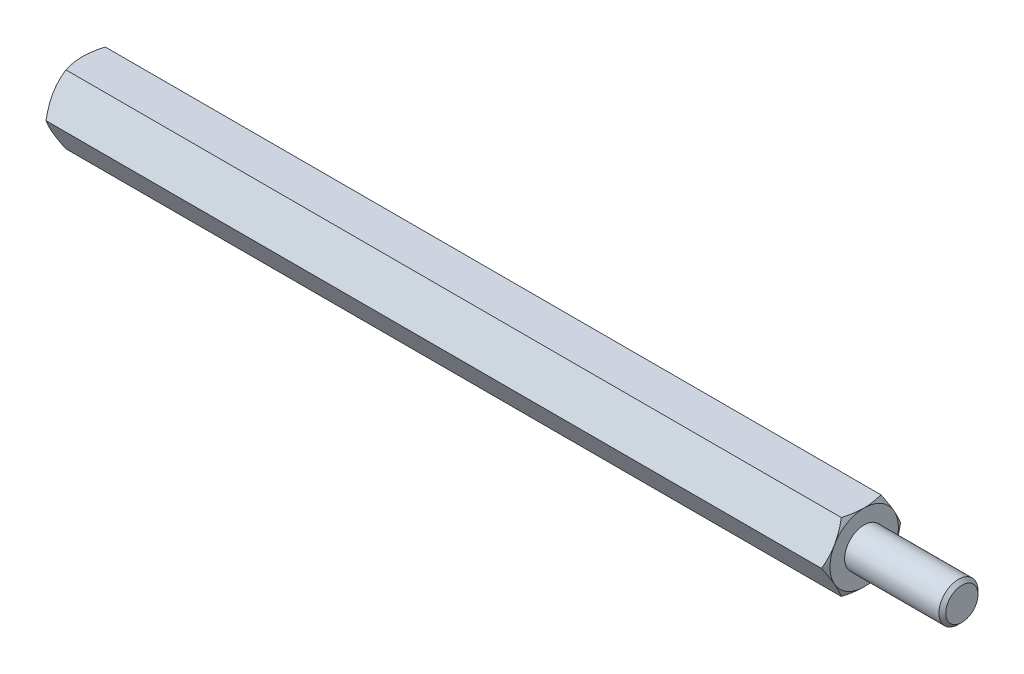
ISO-10303-21;
HEADER;
FILE_DESCRIPTION(('STEP AP214'),'2;1');
FILE_NAME('part.step','',(''),(''),'','','');
FILE_SCHEMA(('AUTOMOTIVE_DESIGN { 1 0 10303 214 1 1 1 1 }'));
ENDSEC;
DATA;
#1=APPLICATION_CONTEXT('core data for automotive mechanical design processes');
#2=APPLICATION_PROTOCOL_DEFINITION('international standard','automotive_design',2000,#1);
#3=PRODUCT_CONTEXT('',#1,'mechanical');
#4=PRODUCT('Part','Part','',(#3));
#5=PRODUCT_RELATED_PRODUCT_CATEGORY('part','',(#4));
#6=PRODUCT_DEFINITION_FORMATION('','',#4);
#7=PRODUCT_DEFINITION_CONTEXT('part definition',#1,'design');
#8=PRODUCT_DEFINITION('design','',#6,#7);
#9=PRODUCT_DEFINITION_SHAPE('','',#8);
#10=(LENGTH_UNIT() NAMED_UNIT(*) SI_UNIT(.MILLI.,.METRE.));
#11=(NAMED_UNIT(*) PLANE_ANGLE_UNIT() SI_UNIT($,.RADIAN.));
#12=(NAMED_UNIT(*) SI_UNIT($,.STERADIAN.) SOLID_ANGLE_UNIT());
#13=UNCERTAINTY_MEASURE_WITH_UNIT(LENGTH_MEASURE(1.E-05),#10,'distance_accuracy_value','');
#14=(GEOMETRIC_REPRESENTATION_CONTEXT(3) GLOBAL_UNCERTAINTY_ASSIGNED_CONTEXT((#13)) GLOBAL_UNIT_ASSIGNED_CONTEXT((#10,
#11,#12)) REPRESENTATION_CONTEXT('',''));
#15=CARTESIAN_POINT('',(0.,0.,0.));
#16=DIRECTION('',(0.,0.,1.));
#17=DIRECTION('',(1.,0.,0.));
#18=AXIS2_PLACEMENT_3D('',#15,#16,#17);
#19=CARTESIAN_POINT('',(40.,3.5,-2.02072594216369));
#20=DIRECTION('',(1.,0.,0.));
#21=DIRECTION('',(0.,0.,-1.));
#22=AXIS2_PLACEMENT_3D('',#19,#20,#21);
#23=PLANE('',#22);
#24=CARTESIAN_POINT('',(40.,0.,0.));
#25=DIRECTION('',(1.,0.,0.));
#26=DIRECTION('',(0.,0.,-1.));
#27=AXIS2_PLACEMENT_3D('',#24,#25,#26);
#28=CIRCLE('',#27,3.50000000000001);
#29=CARTESIAN_POINT('',(40.,-1.75000000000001,-3.03108891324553));
#30=VERTEX_POINT('',#29);
#31=CARTESIAN_POINT('',(40.,1.75,-3.03108891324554));
#32=VERTEX_POINT('',#31);
#33=EDGE_CURVE('E288',#30,#32,#28,.T.);
#34=ORIENTED_EDGE('',*,*,#33,.T.);
#35=CARTESIAN_POINT('',(40.,3.5,0.));
#36=VERTEX_POINT('',#35);
#37=EDGE_CURVE('E53',#32,#36,#28,.T.);
#38=ORIENTED_EDGE('',*,*,#37,.T.);
#39=CARTESIAN_POINT('',(40.,1.75,3.03108891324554));
#40=VERTEX_POINT('',#39);
#41=EDGE_CURVE('E296',#36,#40,#28,.T.);
#42=ORIENTED_EDGE('',*,*,#41,.T.);
#43=CARTESIAN_POINT('',(40.,-1.75000000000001,3.03108891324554));
#44=VERTEX_POINT('',#43);
#45=EDGE_CURVE('E301',#40,#44,#28,.T.);
#46=ORIENTED_EDGE('',*,*,#45,.T.);
#47=CARTESIAN_POINT('',(40.,0.,0.));
#48=DIRECTION('',(-1.,0.,0.));
#49=DIRECTION('',(0.,-1.,0.));
#50=AXIS2_PLACEMENT_3D('',#47,#48,#49);
#51=CIRCLE('',#50,3.50000000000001);
#52=CARTESIAN_POINT('',(40.,-3.50000000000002,0.));
#53=VERTEX_POINT('',#52);
#54=EDGE_CURVE('E193',#53,#44,#51,.T.);
#55=ORIENTED_EDGE('',*,*,#54,.F.);
#56=EDGE_CURVE('E61',#53,#30,#28,.T.);
#57=ORIENTED_EDGE('',*,*,#56,.T.);
#58=EDGE_LOOP('',(#34,#38,#42,#46,#55,#57));
#59=FACE_BOUND('',#58,.T.);
#60=CARTESIAN_POINT('',(40.,0.,0.));
#61=DIRECTION('',(1.,0.,0.));
#62=DIRECTION('',(0.,0.,-1.));
#63=AXIS2_PLACEMENT_3D('',#60,#61,#62);
#64=CIRCLE('',#63,2.);
#65=CARTESIAN_POINT('',(40.,0.,-2.));
#66=VERTEX_POINT('',#65);
#67=EDGE_CURVE('E368',#66,#66,#64,.T.);
#68=ORIENTED_EDGE('',*,*,#67,.F.);
#69=EDGE_LOOP('',(#68));
#70=FACE_BOUND('',#69,.T.);
#71=ADVANCED_FACE('F37',(#59,#70),#23,.T.);
#72=CARTESIAN_POINT('',(40.,0.,-4.04145188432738));
#73=DIRECTION('',(0.,-0.5,0.866025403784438));
#74=DIRECTION('',(0.,-0.866025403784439,-0.5));
#75=AXIS2_PLACEMENT_3D('',#72,#73,#74);
#76=PLANE('',#75);
#77=CARTESIAN_POINT('',(39.6873259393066,-0.000200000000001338,-4.04156735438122));
#78=CARTESIAN_POINT('',(39.73861421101,0.153607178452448,-3.9527667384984));
#79=CARTESIAN_POINT('',(39.7852590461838,0.308742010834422,-3.86319960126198));
#80=CARTESIAN_POINT('',(39.8666781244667,0.621698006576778,-3.68251437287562));
#81=CARTESIAN_POINT('',(39.9014235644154,0.779524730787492,-3.59139307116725));
#82=CARTESIAN_POINT('',(39.9555099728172,1.09322221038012,-3.41027974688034));
#83=CARTESIAN_POINT('',(39.9752109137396,1.24904469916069,-3.32031559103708));
#84=CARTESIAN_POINT('',(39.9987298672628,1.56142288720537,-3.13996396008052));
#85=CARTESIAN_POINT('',(40.0025673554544,1.71797745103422,-3.04957714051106));
#86=CARTESIAN_POINT('',(39.994584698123,2.01050921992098,-2.88068384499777));
#87=CARTESIAN_POINT('',(39.9847245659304,2.1465302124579,-2.80215208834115));
#88=CARTESIAN_POINT('',(39.9534735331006,2.41768602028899,-2.64560020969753));
#89=CARTESIAN_POINT('',(39.9320719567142,2.55281989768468,-2.5675806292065));
#90=CARTESIAN_POINT('',(39.8785695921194,2.82453479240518,-2.41070596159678));
#91=CARTESIAN_POINT('',(39.8462420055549,2.96108141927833,-2.33187072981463));
#92=CARTESIAN_POINT('',(39.772871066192,3.2321380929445,-2.17537608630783));
#93=CARTESIAN_POINT('',(39.7318449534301,3.36665161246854,-2.09771466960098));
#94=CARTESIAN_POINT('',(39.6873259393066,3.5002,-2.02061047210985));
#95=B_SPLINE_CURVE_WITH_KNOTS('',3,(#77,#78,#79,#80,#81,#82,#83,#84,#85,#86,#87,#88,#89,#90,#91,
#92,#93,#94),.UNSPECIFIED.,.F.,.F.,(4,2,2,2,2,2,2,2,4),(0.,0.554793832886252,1.11092123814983,
1.65328467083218,2.19498204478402,2.66665130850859,3.13875761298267,3.62133612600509,
4.10296698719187),.UNSPECIFIED.);
#96=CARTESIAN_POINT('',(39.6873926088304,0.,-4.04145188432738));
#97=VERTEX_POINT('',#96);
#98=EDGE_CURVE('E329',#97,#32,#95,.T.);
#99=ORIENTED_EDGE('',*,*,#98,.F.);
#100=DIRECTION('',(-1.,0.,0.));
#101=VECTOR('',#100,1.);
#102=CARTESIAN_POINT('',(40.,0.,-4.04145188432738));
#103=LINE('',#102,#101);
#104=CARTESIAN_POINT('',(-39.6873926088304,0.,-4.04145188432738));
#105=VERTEX_POINT('',#104);
#106=EDGE_CURVE('E264',#97,#105,#103,.T.);
#107=ORIENTED_EDGE('',*,*,#106,.T.);
#108=CARTESIAN_POINT('',(-39.6873259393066,3.5002,-2.02061047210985));
#109=CARTESIAN_POINT('',(-39.73861421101,3.34639282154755,-2.10941108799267));
#110=CARTESIAN_POINT('',(-39.7852590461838,3.19125798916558,-2.19897822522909));
#111=CARTESIAN_POINT('',(-39.8666781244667,2.87830199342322,-2.37966345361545));
#112=CARTESIAN_POINT('',(-39.9014235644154,2.7204752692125,-2.47078475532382));
#113=CARTESIAN_POINT('',(-39.9555099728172,2.40677778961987,-2.65189807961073));
#114=CARTESIAN_POINT('',(-39.9752109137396,2.25095530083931,-2.74186223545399));
#115=CARTESIAN_POINT('',(-39.9987298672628,1.93857711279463,-2.92221386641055));
#116=CARTESIAN_POINT('',(-40.0025673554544,1.78202254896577,-3.01260068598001));
#117=CARTESIAN_POINT('',(-39.994584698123,1.48949078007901,-3.1814939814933));
#118=CARTESIAN_POINT('',(-39.9847245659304,1.35346978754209,-3.26002573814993));
#119=CARTESIAN_POINT('',(-39.9534735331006,1.08231397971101,-3.41657761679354));
#120=CARTESIAN_POINT('',(-39.9320719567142,0.947180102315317,-3.49459719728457));
#121=CARTESIAN_POINT('',(-39.8785695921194,0.675465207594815,-3.65147186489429));
#122=CARTESIAN_POINT('',(-39.8462420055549,0.538918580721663,-3.73030709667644));
#123=CARTESIAN_POINT('',(-39.772871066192,0.267861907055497,-3.88680174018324));
#124=CARTESIAN_POINT('',(-39.7318449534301,0.133348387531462,-3.96446315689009));
#125=CARTESIAN_POINT('',(-39.6873259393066,-0.000200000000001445,-4.04156735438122));
#126=B_SPLINE_CURVE_WITH_KNOTS('',3,(#108,#109,#110,#111,#112,#113,#114,#115,#116,#117,#118,
#119,#120,#121,#122,#123,#124,#125),.UNSPECIFIED.,.F.,.F.,(4,2,2,2,2,2,2,2,4),(0.,
0.554793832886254,1.11092123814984,1.65328467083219,2.19498204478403,2.6666513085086,
3.13875761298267,3.6213361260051,4.10296698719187),.UNSPECIFIED.);
#127=CARTESIAN_POINT('',(-40.,1.75,-3.03108891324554));
#128=VERTEX_POINT('',#127);
#129=EDGE_CURVE('E406',#128,#105,#126,.T.);
#130=ORIENTED_EDGE('',*,*,#129,.F.);
#131=CARTESIAN_POINT('',(-39.6873926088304,3.5,-2.02072594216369));
#132=VERTEX_POINT('',#131);
#133=EDGE_CURVE('E383',#132,#128,#126,.T.);
#134=ORIENTED_EDGE('',*,*,#133,.F.);
#135=DIRECTION('',(-1.,0.,0.));
#136=VECTOR('',#135,1.);
#137=CARTESIAN_POINT('',(40.,3.5,-2.02072594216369));
#138=LINE('',#137,#136);
#139=CARTESIAN_POINT('',(39.6873926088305,3.5,-2.02072594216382));
#140=VERTEX_POINT('',#139);
#141=EDGE_CURVE('E279',#140,#132,#138,.T.);
#142=ORIENTED_EDGE('',*,*,#141,.F.);
#143=EDGE_CURVE('E229',#32,#140,#95,.T.);
#144=ORIENTED_EDGE('',*,*,#143,.F.);
#145=EDGE_LOOP('',(#99,#107,#130,#134,#142,#144));
#146=FACE_BOUND('',#145,.T.);
#147=ADVANCED_FACE('F148',(#146),#76,.F.);
#148=CARTESIAN_POINT('',(40.,3.5,-2.02072594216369));
#149=DIRECTION('',(0.,-1.,0.));
#150=DIRECTION('',(0.,0.,-1.));
#151=AXIS2_PLACEMENT_3D('',#148,#149,#150);
#152=PLANE('',#151);
#153=CARTESIAN_POINT('',(38.2443294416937,3.5,-5.525713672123));
#154=CARTESIAN_POINT('',(38.3192813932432,3.5,-5.37200190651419));
#155=CARTESIAN_POINT('',(38.393542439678,3.5,-5.21794762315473));
#156=CARTESIAN_POINT('',(38.5402960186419,3.5,-4.90897223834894));
#157=CARTESIAN_POINT('',(38.6127882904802,3.5,-4.75405101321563));
#158=CARTESIAN_POINT('',(38.7559617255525,3.5,-4.44240758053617));
#159=CARTESIAN_POINT('',(38.8266316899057,3.5,-4.28568021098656));
#160=CARTESIAN_POINT('',(38.9652074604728,3.5,-3.97101270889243));
#161=CARTESIAN_POINT('',(39.0331133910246,3.5,-3.81307263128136));
#162=CARTESIAN_POINT('',(39.1677143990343,3.5,-3.49026114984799));
#163=CARTESIAN_POINT('',(39.2342871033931,3.5,-3.32533845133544));
#164=CARTESIAN_POINT('',(39.3626267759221,3.5,-2.99359992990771));
#165=CARTESIAN_POINT('',(39.4243932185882,3.5,-2.82678390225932));
#166=CARTESIAN_POINT('',(39.5415700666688,3.5,-2.49127529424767));
#167=CARTESIAN_POINT('',(39.5969925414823,3.5,-2.32258697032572));
#168=CARTESIAN_POINT('',(39.6997679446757,3.5,-1.98279215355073));
#169=CARTESIAN_POINT('',(39.7471233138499,3.5,-1.81168640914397));
#170=CARTESIAN_POINT('',(39.8312987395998,3.5,-1.46793354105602));
#171=CARTESIAN_POINT('',(39.8681796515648,3.5,-1.2953015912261));
#172=CARTESIAN_POINT('',(39.9293955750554,3.5,-0.947791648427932));
#173=CARTESIAN_POINT('',(39.953731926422,3.5,-0.77291389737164));
#174=CARTESIAN_POINT('',(39.9876038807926,3.5,-0.424108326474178));
#175=CARTESIAN_POINT('',(39.997337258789,3.5,-0.25020019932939));
#176=CARTESIAN_POINT('',(40.0017053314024,3.5,0.0978233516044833));
#177=CARTESIAN_POINT('',(39.9963399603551,3.5,0.271938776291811));
#178=CARTESIAN_POINT('',(39.9750118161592,3.5,0.564711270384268));
#179=CARTESIAN_POINT('',(39.9628919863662,3.5,0.683667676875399));
#180=CARTESIAN_POINT('',(39.9323080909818,3.5,0.920767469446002));
#181=CARTESIAN_POINT('',(39.9138432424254,3.5,1.03891075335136));
#182=CARTESIAN_POINT('',(39.8498956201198,3.5,1.39193174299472));
#183=CARTESIAN_POINT('',(39.7958695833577,3.5,1.62528232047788));
#184=CARTESIAN_POINT('',(39.7014515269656,3.5,1.9743382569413));
#185=CARTESIAN_POINT('',(39.6672900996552,3.5,2.09183268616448));
#186=CARTESIAN_POINT('',(39.595234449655,3.5,2.32568238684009));
#187=CARTESIAN_POINT('',(39.5573401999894,3.5,2.44203765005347));
#188=CARTESIAN_POINT('',(39.4784421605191,3.5,2.67364238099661));
#189=CARTESIAN_POINT('',(39.4374392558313,3.5,2.7888921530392));
#190=CARTESIAN_POINT('',(39.352824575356,3.5,3.0184246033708));
#191=CARTESIAN_POINT('',(39.3092128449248,3.5,3.13270729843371));
#192=CARTESIAN_POINT('',(39.1958241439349,3.5,3.42150510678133));
#193=CARTESIAN_POINT('',(39.1245636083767,3.5,3.59543696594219));
#194=CARTESIAN_POINT('',(38.9781026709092,3.5,3.94163961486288));
#195=CARTESIAN_POINT('',(38.9029019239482,3.5,4.11391025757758));
#196=CARTESIAN_POINT('',(38.7494252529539,3.5,4.45713072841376));
#197=CARTESIAN_POINT('',(38.6711484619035,3.5,4.62808016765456));
#198=CARTESIAN_POINT('',(38.512188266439,3.5,4.96885843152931));
#199=CARTESIAN_POINT('',(38.4315047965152,3.5,5.1386872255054));
#200=CARTESIAN_POINT('',(38.1863871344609,3.5,5.64726192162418));
#201=CARTESIAN_POINT('',(38.0190975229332,3.5,5.98463020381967));
#202=CARTESIAN_POINT('',(37.6795854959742,3.5,6.65678495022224));
#203=CARTESIAN_POINT('',(37.5073639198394,3.5,6.99157184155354));
#204=CARTESIAN_POINT('',(37.1760800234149,3.5,7.62749570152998));
#205=CARTESIAN_POINT('',(37.0173299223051,3.5,7.92879562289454));
#206=CARTESIAN_POINT('',(36.6977473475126,3.5,8.53030635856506));
#207=CARTESIAN_POINT('',(36.5369147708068,3.5,8.83051711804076));
#208=CARTESIAN_POINT('',(36.2141792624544,3.5,9.42918006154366));
#209=CARTESIAN_POINT('',(36.0522810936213,3.5,9.72763481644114));
#210=CARTESIAN_POINT('',(35.7272737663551,3.5,10.3238577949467));
#211=CARTESIAN_POINT('',(35.5641646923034,3.5,10.6216260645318));
#212=CARTESIAN_POINT('',(35.4006104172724,3.5,10.9191478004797));
#213=B_SPLINE_CURVE_WITH_KNOTS('',3,(#153,#154,#155,#156,#157,#158,#159,#160,#161,#162,#163,
#164,#165,#166,#167,#168,#169,#170,#171,#172,#173,#174,#175,#176,#177,#178,#179,#180,#181,#182,
#183,#184,#185,#186,#187,#188,#189,#190,#191,#192,#193,#194,#195,#196,#197,#198,#199,#200,#201,
#202,#203,#204,#205,#206,#207,#208,#209,#210,#211,#212),.UNSPECIFIED.,.F.,.F.,(4,2,2,2,2,2,2,2,
2,2,2,2,2,2,2,2,2,2,2,2,2,2,2,2,2,2,2,2,2,4),(0.,0.513041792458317,1.02615874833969,
1.54190801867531,2.05763406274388,2.59113284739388,3.1246898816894,3.65721433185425,
4.18957737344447,4.71878103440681,5.24792816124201,5.76984197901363,6.29175806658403,
6.65030258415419,7.00889136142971,7.72642330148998,8.0934692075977,8.46051776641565,
8.82746220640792,9.19440026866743,9.75822236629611,10.3220939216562,10.8861255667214,
11.4501725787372,12.579801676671,13.7092396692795,14.730918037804,15.7526471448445,
16.771258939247,17.7898004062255),.UNSPECIFIED.);
#214=EDGE_CURVE('E227',#140,#36,#213,.T.);
#215=ORIENTED_EDGE('',*,*,#214,.F.);
#216=ORIENTED_EDGE('',*,*,#141,.T.);
#217=CARTESIAN_POINT('',(-38.2443294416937,3.5,-5.525713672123));
#218=CARTESIAN_POINT('',(-38.3192813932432,3.5,-5.37200190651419));
#219=CARTESIAN_POINT('',(-38.393542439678,3.5,-5.21794762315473));
#220=CARTESIAN_POINT('',(-38.5402960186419,3.5,-4.90897223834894));
#221=CARTESIAN_POINT('',(-38.6127882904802,3.5,-4.75405101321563));
#222=CARTESIAN_POINT('',(-38.7559617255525,3.5,-4.44240758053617));
#223=CARTESIAN_POINT('',(-38.8266316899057,3.5,-4.28568021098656));
#224=CARTESIAN_POINT('',(-38.9652074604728,3.5,-3.97101270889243));
#225=CARTESIAN_POINT('',(-39.0331133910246,3.5,-3.81307263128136));
#226=CARTESIAN_POINT('',(-39.1677143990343,3.5,-3.49026114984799));
#227=CARTESIAN_POINT('',(-39.2342871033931,3.5,-3.32533845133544));
#228=CARTESIAN_POINT('',(-39.3626267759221,3.5,-2.99359992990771));
#229=CARTESIAN_POINT('',(-39.4243932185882,3.5,-2.82678390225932));
#230=CARTESIAN_POINT('',(-39.5415700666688,3.5,-2.49127529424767));
#231=CARTESIAN_POINT('',(-39.5969925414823,3.5,-2.32258697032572));
#232=CARTESIAN_POINT('',(-39.6997679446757,3.5,-1.98279215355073));
#233=CARTESIAN_POINT('',(-39.7471233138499,3.5,-1.81168640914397));
#234=CARTESIAN_POINT('',(-39.8312987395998,3.5,-1.46793354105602));
#235=CARTESIAN_POINT('',(-39.8681796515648,3.5,-1.2953015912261));
#236=CARTESIAN_POINT('',(-39.9293955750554,3.5,-0.947791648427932));
#237=CARTESIAN_POINT('',(-39.953731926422,3.5,-0.77291389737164));
#238=CARTESIAN_POINT('',(-39.9876038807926,3.5,-0.424108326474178));
#239=CARTESIAN_POINT('',(-39.997337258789,3.5,-0.25020019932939));
#240=CARTESIAN_POINT('',(-40.0017053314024,3.5,0.0978233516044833));
#241=CARTESIAN_POINT('',(-39.9963399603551,3.5,0.271938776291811));
#242=CARTESIAN_POINT('',(-39.9750118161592,3.5,0.564711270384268));
#243=CARTESIAN_POINT('',(-39.9628919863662,3.5,0.683667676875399));
#244=CARTESIAN_POINT('',(-39.9323080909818,3.5,0.920767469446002));
#245=CARTESIAN_POINT('',(-39.9138432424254,3.5,1.03891075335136));
#246=CARTESIAN_POINT('',(-39.8498956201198,3.5,1.39193174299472));
#247=CARTESIAN_POINT('',(-39.7958695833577,3.5,1.62528232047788));
#248=CARTESIAN_POINT('',(-39.7014515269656,3.5,1.9743382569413));
#249=CARTESIAN_POINT('',(-39.6672900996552,3.5,2.09183268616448));
#250=CARTESIAN_POINT('',(-39.595234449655,3.5,2.32568238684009));
#251=CARTESIAN_POINT('',(-39.5573401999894,3.5,2.44203765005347));
#252=CARTESIAN_POINT('',(-39.4784421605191,3.5,2.67364238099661));
#253=CARTESIAN_POINT('',(-39.4374392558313,3.5,2.7888921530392));
#254=CARTESIAN_POINT('',(-39.352824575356,3.5,3.0184246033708));
#255=CARTESIAN_POINT('',(-39.3092128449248,3.5,3.13270729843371));
#256=CARTESIAN_POINT('',(-39.1958241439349,3.5,3.42150510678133));
#257=CARTESIAN_POINT('',(-39.1245636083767,3.5,3.59543696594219));
#258=CARTESIAN_POINT('',(-38.9781026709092,3.5,3.94163961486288));
#259=CARTESIAN_POINT('',(-38.9029019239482,3.5,4.11391025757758));
#260=CARTESIAN_POINT('',(-38.7494252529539,3.5,4.45713072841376));
#261=CARTESIAN_POINT('',(-38.6711484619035,3.5,4.62808016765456));
#262=CARTESIAN_POINT('',(-38.512188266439,3.5,4.96885843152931));
#263=CARTESIAN_POINT('',(-38.4315047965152,3.5,5.1386872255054));
#264=CARTESIAN_POINT('',(-38.1863871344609,3.5,5.64726192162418));
#265=CARTESIAN_POINT('',(-38.0190975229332,3.5,5.98463020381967));
#266=CARTESIAN_POINT('',(-37.6795854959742,3.5,6.65678495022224));
#267=CARTESIAN_POINT('',(-37.5073639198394,3.5,6.99157184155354));
#268=CARTESIAN_POINT('',(-37.1760800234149,3.5,7.62749570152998));
#269=CARTESIAN_POINT('',(-37.0173299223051,3.5,7.92879562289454));
#270=CARTESIAN_POINT('',(-36.6977473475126,3.5,8.53030635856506));
#271=CARTESIAN_POINT('',(-36.5369147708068,3.5,8.83051711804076));
#272=CARTESIAN_POINT('',(-36.2141792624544,3.5,9.42918006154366));
#273=CARTESIAN_POINT('',(-36.0522810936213,3.5,9.72763481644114));
#274=CARTESIAN_POINT('',(-35.7272737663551,3.5,10.3238577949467));
#275=CARTESIAN_POINT('',(-35.5641646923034,3.5,10.6216260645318));
#276=CARTESIAN_POINT('',(-35.4006104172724,3.5,10.9191478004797));
#277=B_SPLINE_CURVE_WITH_KNOTS('',3,(#217,#218,#219,#220,#221,#222,#223,#224,#225,#226,#227,
#228,#229,#230,#231,#232,#233,#234,#235,#236,#237,#238,#239,#240,#241,#242,#243,#244,#245,#246,
#247,#248,#249,#250,#251,#252,#253,#254,#255,#256,#257,#258,#259,#260,#261,#262,#263,#264,#265,
#266,#267,#268,#269,#270,#271,#272,#273,#274,#275,#276),.UNSPECIFIED.,.F.,.F.,(4,2,2,2,2,2,2,2,
2,2,2,2,2,2,2,2,2,2,2,2,2,2,2,2,2,2,2,2,2,4),(0.,0.513041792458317,1.02615874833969,
1.54190801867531,2.05763406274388,2.59113284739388,3.1246898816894,3.65721433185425,
4.18957737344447,4.71878103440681,5.24792816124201,5.76984197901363,6.29175806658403,
6.65030258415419,7.00889136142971,7.72642330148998,8.0934692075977,8.46051776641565,
8.82746220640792,9.19440026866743,9.75822236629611,10.3220939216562,10.8861255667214,
11.4501725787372,12.579801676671,13.7092396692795,14.730918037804,15.7526471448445,
16.771258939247,17.7898004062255),.UNSPECIFIED.);
#278=CARTESIAN_POINT('',(-40.,3.5,0.));
#279=VERTEX_POINT('',#278);
#280=EDGE_CURVE('E241',#279,#132,#277,.F.);
#281=ORIENTED_EDGE('',*,*,#280,.F.);
#282=CARTESIAN_POINT('',(-39.6873926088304,3.5,2.02072594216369));
#283=VERTEX_POINT('',#282);
#284=EDGE_CURVE('E249',#283,#279,#277,.F.);
#285=ORIENTED_EDGE('',*,*,#284,.F.);
#286=DIRECTION('',(-1.,0.,0.));
#287=VECTOR('',#286,1.);
#288=CARTESIAN_POINT('',(40.,3.5,2.02072594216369));
#289=LINE('',#288,#287);
#290=CARTESIAN_POINT('',(39.6873926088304,3.5,2.02072594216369));
#291=VERTEX_POINT('',#290);
#292=EDGE_CURVE('E276',#291,#283,#289,.T.);
#293=ORIENTED_EDGE('',*,*,#292,.F.);
#294=EDGE_CURVE('E221',#36,#291,#213,.T.);
#295=ORIENTED_EDGE('',*,*,#294,.F.);
#296=EDGE_LOOP('',(#215,#216,#281,#285,#293,#295));
#297=FACE_BOUND('',#296,.T.);
#298=ADVANCED_FACE('F153',(#297),#152,.F.);
#299=CARTESIAN_POINT('',(40.,3.5,2.02072594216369));
#300=DIRECTION('',(0.,-0.5,-0.866025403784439));
#301=DIRECTION('',(0.,0.866025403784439,-0.5));
#302=AXIS2_PLACEMENT_3D('',#299,#300,#301);
#303=PLANE('',#302);
#304=CARTESIAN_POINT('',(39.6873259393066,3.5002,2.02061047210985));
#305=CARTESIAN_POINT('',(39.73861421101,3.34639282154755,2.10941108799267));
#306=CARTESIAN_POINT('',(39.7852590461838,3.19125798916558,2.19897822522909));
#307=CARTESIAN_POINT('',(39.8666781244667,2.87830199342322,2.37966345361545));
#308=CARTESIAN_POINT('',(39.9014235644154,2.7204752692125,2.47078475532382));
#309=CARTESIAN_POINT('',(39.9555099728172,2.40677778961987,2.65189807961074));
#310=CARTESIAN_POINT('',(39.9752109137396,2.25095530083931,2.74186223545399));
#311=CARTESIAN_POINT('',(39.9987298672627,1.93857711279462,2.92221386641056));
#312=CARTESIAN_POINT('',(40.0025673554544,1.78202254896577,3.01260068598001));
#313=CARTESIAN_POINT('',(39.994584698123,1.48949078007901,3.1814939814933));
#314=CARTESIAN_POINT('',(39.9847245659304,1.35346978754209,3.26002573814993));
#315=CARTESIAN_POINT('',(39.9534735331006,1.082313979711,3.41657761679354));
#316=CARTESIAN_POINT('',(39.9320719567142,0.947180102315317,3.49459719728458));
#317=CARTESIAN_POINT('',(39.8785695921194,0.675465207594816,3.65147186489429));
#318=CARTESIAN_POINT('',(39.8462420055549,0.538918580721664,3.73030709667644));
#319=CARTESIAN_POINT('',(39.772871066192,0.267861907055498,3.88680174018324));
#320=CARTESIAN_POINT('',(39.7318449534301,0.133348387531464,3.96446315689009));
#321=CARTESIAN_POINT('',(39.6873259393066,-0.000200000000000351,4.04156735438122));
#322=B_SPLINE_CURVE_WITH_KNOTS('',3,(#304,#305,#306,#307,#308,#309,#310,#311,#312,#313,#314,
#315,#316,#317,#318,#319,#320,#321),.UNSPECIFIED.,.F.,.F.,(4,2,2,2,2,2,2,2,4),(0.,
0.554793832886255,1.11092123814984,1.65328467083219,2.19498204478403,2.6666513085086,
3.13875761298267,3.62133612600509,4.10296698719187),.UNSPECIFIED.);
#323=EDGE_CURVE('E228',#291,#40,#322,.T.);
#324=ORIENTED_EDGE('',*,*,#323,.F.);
#325=ORIENTED_EDGE('',*,*,#292,.T.);
#326=CARTESIAN_POINT('',(-39.6873259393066,-0.000200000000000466,4.04156735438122));
#327=CARTESIAN_POINT('',(-39.73861421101,0.153607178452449,3.9527667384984));
#328=CARTESIAN_POINT('',(-39.7852590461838,0.308742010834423,3.86319960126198));
#329=CARTESIAN_POINT('',(-39.8666781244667,0.62169800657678,3.68251437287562));
#330=CARTESIAN_POINT('',(-39.9014235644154,0.779524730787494,3.59139307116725));
#331=CARTESIAN_POINT('',(-39.9555099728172,1.09322221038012,3.41027974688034));
#332=CARTESIAN_POINT('',(-39.9752109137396,1.24904469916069,3.32031559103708));
#333=CARTESIAN_POINT('',(-39.9987298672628,1.56142288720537,3.13996396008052));
#334=CARTESIAN_POINT('',(-40.0025673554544,1.71797745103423,3.04957714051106));
#335=CARTESIAN_POINT('',(-39.994584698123,2.01050921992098,2.88068384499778));
#336=CARTESIAN_POINT('',(-39.9847245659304,2.1465302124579,2.80215208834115));
#337=CARTESIAN_POINT('',(-39.9534735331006,2.41768602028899,2.64560020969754));
#338=CARTESIAN_POINT('',(-39.9320719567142,2.55281989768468,2.5675806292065));
#339=CARTESIAN_POINT('',(-39.8785695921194,2.82453479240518,2.41070596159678));
#340=CARTESIAN_POINT('',(-39.8462420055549,2.96108141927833,2.33187072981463));
#341=CARTESIAN_POINT('',(-39.772871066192,3.2321380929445,2.17537608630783));
#342=CARTESIAN_POINT('',(-39.7318449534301,3.36665161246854,2.09771466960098));
#343=CARTESIAN_POINT('',(-39.6873259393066,3.5002,2.02061047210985));
#344=B_SPLINE_CURVE_WITH_KNOTS('',3,(#326,#327,#328,#329,#330,#331,#332,#333,#334,#335,#336,
#337,#338,#339,#340,#341,#342,#343),.UNSPECIFIED.,.F.,.F.,(4,2,2,2,2,2,2,2,4),(0.,
0.554793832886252,1.11092123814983,1.65328467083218,2.19498204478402,2.66665130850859,
3.13875761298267,3.62133612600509,4.10296698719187),.UNSPECIFIED.);
#345=CARTESIAN_POINT('',(-40.,1.75,3.03108891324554));
#346=VERTEX_POINT('',#345);
#347=EDGE_CURVE('E255',#346,#283,#344,.T.);
#348=ORIENTED_EDGE('',*,*,#347,.F.);
#349=CARTESIAN_POINT('',(-39.6873926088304,0.,4.04145188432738));
#350=VERTEX_POINT('',#349);
#351=EDGE_CURVE('E262',#350,#346,#344,.T.);
#352=ORIENTED_EDGE('',*,*,#351,.F.);
#353=DIRECTION('',(-1.,0.,0.));
#354=VECTOR('',#353,1.);
#355=CARTESIAN_POINT('',(40.,0.,4.04145188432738));
#356=LINE('',#355,#354);
#357=CARTESIAN_POINT('',(39.6873926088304,0.,4.04145188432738));
#358=VERTEX_POINT('',#357);
#359=EDGE_CURVE('E273',#358,#350,#356,.T.);
#360=ORIENTED_EDGE('',*,*,#359,.F.);
#361=EDGE_CURVE('E215',#40,#358,#322,.T.);
#362=ORIENTED_EDGE('',*,*,#361,.F.);
#363=EDGE_LOOP('',(#324,#325,#348,#352,#360,#362));
#364=FACE_BOUND('',#363,.T.);
#365=ADVANCED_FACE('F235',(#364),#303,.F.);
#366=CARTESIAN_POINT('',(40.,0.,4.04145188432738));
#367=DIRECTION('',(0.,0.5,-0.866025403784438));
#368=DIRECTION('',(0.,0.866025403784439,0.5));
#369=AXIS2_PLACEMENT_3D('',#366,#367,#368);
#370=PLANE('',#369);
#371=CARTESIAN_POINT('',(39.6873259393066,0.000199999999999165,4.04156735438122));
#372=CARTESIAN_POINT('',(39.73861421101,-0.15360717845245,3.9527667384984));
#373=CARTESIAN_POINT('',(39.7852590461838,-0.308742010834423,3.86319960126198));
#374=CARTESIAN_POINT('',(39.8666781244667,-0.62169800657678,3.68251437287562));
#375=CARTESIAN_POINT('',(39.9014235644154,-0.779524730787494,3.59139307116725));
#376=CARTESIAN_POINT('',(39.9555099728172,-1.09322221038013,3.41027974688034));
#377=CARTESIAN_POINT('',(39.9752109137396,-1.24904469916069,3.32031559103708));
#378=CARTESIAN_POINT('',(39.9987298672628,-1.56142288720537,3.13996396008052));
#379=CARTESIAN_POINT('',(40.0025673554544,-1.71797745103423,3.04957714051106));
#380=CARTESIAN_POINT('',(39.994584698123,-2.01050921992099,2.88068384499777));
#381=CARTESIAN_POINT('',(39.9847245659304,-2.1465302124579,2.80215208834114));
#382=CARTESIAN_POINT('',(39.9534735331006,-2.41768602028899,2.64560020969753));
#383=CARTESIAN_POINT('',(39.9320719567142,-2.55281989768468,2.5675806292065));
#384=CARTESIAN_POINT('',(39.8785695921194,-2.82453479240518,2.41070596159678));
#385=CARTESIAN_POINT('',(39.8462420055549,-2.96108141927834,2.33187072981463));
#386=CARTESIAN_POINT('',(39.772871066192,-3.2321380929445,2.17537608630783));
#387=CARTESIAN_POINT('',(39.7318449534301,-3.36665161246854,2.09771466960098));
#388=CARTESIAN_POINT('',(39.6873259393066,-3.5002,2.02061047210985));
#389=B_SPLINE_CURVE_WITH_KNOTS('',3,(#371,#372,#373,#374,#375,#376,#377,#378,#379,#380,#381,
#382,#383,#384,#385,#386,#387,#388),.UNSPECIFIED.,.F.,.F.,(4,2,2,2,2,2,2,2,4),(0.,
0.55479383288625,1.11092123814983,1.65328467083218,2.19498204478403,2.6666513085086,
3.13875761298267,3.62133612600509,4.10296698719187),.UNSPECIFIED.);
#390=EDGE_CURVE('E353',#358,#44,#389,.T.);
#391=ORIENTED_EDGE('',*,*,#390,.F.);
#392=ORIENTED_EDGE('',*,*,#359,.T.);
#393=CARTESIAN_POINT('',(-39.6873259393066,-3.5002,2.02061047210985));
#394=CARTESIAN_POINT('',(-39.73861421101,-3.34639282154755,2.10941108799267));
#395=CARTESIAN_POINT('',(-39.7852590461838,-3.19125798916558,2.19897822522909));
#396=CARTESIAN_POINT('',(-39.8666781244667,-2.87830199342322,2.37966345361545));
#397=CARTESIAN_POINT('',(-39.9014235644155,-2.72047526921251,2.47078475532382));
#398=CARTESIAN_POINT('',(-39.9555099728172,-2.40677778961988,2.65189807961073));
#399=CARTESIAN_POINT('',(-39.9752109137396,-2.25095530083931,2.74186223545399));
#400=CARTESIAN_POINT('',(-39.9987298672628,-1.93857711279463,2.92221386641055));
#401=CARTESIAN_POINT('',(-40.0025673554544,-1.78202254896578,3.01260068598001));
#402=CARTESIAN_POINT('',(-39.994584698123,-1.48949078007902,3.18149398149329));
#403=CARTESIAN_POINT('',(-39.9847245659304,-1.3534697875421,3.26002573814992));
#404=CARTESIAN_POINT('',(-39.9534735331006,-1.08231397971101,3.41657761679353));
#405=CARTESIAN_POINT('',(-39.9320719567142,-0.947180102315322,3.49459719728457));
#406=CARTESIAN_POINT('',(-39.8785695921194,-0.67546520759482,3.65147186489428));
#407=CARTESIAN_POINT('',(-39.8462420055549,-0.538918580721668,3.73030709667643));
#408=CARTESIAN_POINT('',(-39.772871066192,-0.267861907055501,3.88680174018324));
#409=CARTESIAN_POINT('',(-39.7318449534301,-0.133348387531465,3.96446315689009));
#410=CARTESIAN_POINT('',(-39.6873259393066,0.000199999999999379,4.04156735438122));
#411=B_SPLINE_CURVE_WITH_KNOTS('',3,(#393,#394,#395,#396,#397,#398,#399,#400,#401,#402,#403,
#404,#405,#406,#407,#408,#409,#410),.UNSPECIFIED.,.F.,.F.,(4,2,2,2,2,2,2,2,4),(0.,
0.554793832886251,1.11092123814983,1.65328467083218,2.19498204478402,2.66665130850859,
3.13875761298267,3.62133612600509,4.10296698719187),.UNSPECIFIED.);
#412=CARTESIAN_POINT('',(-40.,-1.75000000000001,3.03108891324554));
#413=VERTEX_POINT('',#412);
#414=EDGE_CURVE('E263',#413,#350,#411,.T.);
#415=ORIENTED_EDGE('',*,*,#414,.F.);
#416=CARTESIAN_POINT('',(-39.6873926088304,-3.5,2.02072594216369));
#417=VERTEX_POINT('',#416);
#418=EDGE_CURVE('E250',#417,#413,#411,.T.);
#419=ORIENTED_EDGE('',*,*,#418,.F.);
#420=DIRECTION('',(-1.,0.,0.));
#421=VECTOR('',#420,1.);
#422=CARTESIAN_POINT('',(40.,-3.5,2.02072594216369));
#423=LINE('',#422,#421);
#424=CARTESIAN_POINT('',(39.6873926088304,-3.5,2.02072594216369));
#425=VERTEX_POINT('',#424);
#426=EDGE_CURVE('E270',#425,#417,#423,.T.);
#427=ORIENTED_EDGE('',*,*,#426,.F.);
#428=EDGE_CURVE('E210',#44,#425,#389,.T.);
#429=ORIENTED_EDGE('',*,*,#428,.F.);
#430=EDGE_LOOP('',(#391,#392,#415,#419,#427,#429));
#431=FACE_BOUND('',#430,.T.);
#432=ADVANCED_FACE('F429',(#431),#370,.F.);
#433=CARTESIAN_POINT('',(40.,-3.5,2.02072594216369));
#434=DIRECTION('',(0.,1.,0.));
#435=DIRECTION('',(0.,0.,1.));
#436=AXIS2_PLACEMENT_3D('',#433,#434,#435);
#437=PLANE('',#436);
#438=CARTESIAN_POINT('',(38.2443294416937,-3.5,-5.52571367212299));
#439=CARTESIAN_POINT('',(38.3192813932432,-3.5,-5.37200190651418));
#440=CARTESIAN_POINT('',(38.393542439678,-3.5,-5.21794762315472));
#441=CARTESIAN_POINT('',(38.5402960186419,-3.5,-4.90897223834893));
#442=CARTESIAN_POINT('',(38.6127882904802,-3.5,-4.75405101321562));
#443=CARTESIAN_POINT('',(38.7559617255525,-3.5,-4.44240758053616));
#444=CARTESIAN_POINT('',(38.8266316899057,-3.5,-4.28568021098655));
#445=CARTESIAN_POINT('',(38.9652074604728,-3.5,-3.97101270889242));
#446=CARTESIAN_POINT('',(39.0331133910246,-3.5,-3.81307263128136));
#447=CARTESIAN_POINT('',(39.1677143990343,-3.5,-3.49026114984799));
#448=CARTESIAN_POINT('',(39.2342871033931,-3.5,-3.32533845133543));
#449=CARTESIAN_POINT('',(39.3626267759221,-3.5,-2.99359992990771));
#450=CARTESIAN_POINT('',(39.4243932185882,-3.5,-2.82678390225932));
#451=CARTESIAN_POINT('',(39.5415700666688,-3.5,-2.49127529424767));
#452=CARTESIAN_POINT('',(39.5969925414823,-3.5,-2.32258697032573));
#453=CARTESIAN_POINT('',(39.6997679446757,-3.5,-1.98279215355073));
#454=CARTESIAN_POINT('',(39.7471233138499,-3.5,-1.81168640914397));
#455=CARTESIAN_POINT('',(39.8312987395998,-3.5,-1.46793354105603));
#456=CARTESIAN_POINT('',(39.8681796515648,-3.5,-1.2953015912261));
#457=CARTESIAN_POINT('',(39.9293955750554,-3.5,-0.947791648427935));
#458=CARTESIAN_POINT('',(39.953731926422,-3.5,-0.772913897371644));
#459=CARTESIAN_POINT('',(39.9876038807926,-3.5,-0.424108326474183));
#460=CARTESIAN_POINT('',(39.997337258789,-3.5,-0.250200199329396));
#461=CARTESIAN_POINT('',(40.0017053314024,-3.5,0.0978233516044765));
#462=CARTESIAN_POINT('',(39.9963399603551,-3.5,0.271938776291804));
#463=CARTESIAN_POINT('',(39.9750118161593,-3.5,0.564711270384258));
#464=CARTESIAN_POINT('',(39.9628919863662,-3.5,0.683667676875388));
#465=CARTESIAN_POINT('',(39.9323080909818,-3.5,0.920767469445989));
#466=CARTESIAN_POINT('',(39.9138432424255,-3.5,1.03891075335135));
#467=CARTESIAN_POINT('',(39.8498956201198,-3.5,1.3919317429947));
#468=CARTESIAN_POINT('',(39.7958695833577,-3.5,1.62528232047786));
#469=CARTESIAN_POINT('',(39.7014515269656,-3.5,1.97433825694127));
#470=CARTESIAN_POINT('',(39.6672900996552,-3.5,2.09183268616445));
#471=CARTESIAN_POINT('',(39.5952344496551,-3.5,2.32568238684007));
#472=CARTESIAN_POINT('',(39.5573401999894,-3.5,2.44203765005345));
#473=CARTESIAN_POINT('',(39.4784421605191,-3.5,2.67364238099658));
#474=CARTESIAN_POINT('',(39.4374392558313,-3.5,2.78889215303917));
#475=CARTESIAN_POINT('',(39.352824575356,-3.5,3.01842460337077));
#476=CARTESIAN_POINT('',(39.3092128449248,-3.5,3.13270729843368));
#477=CARTESIAN_POINT('',(39.1958241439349,-3.5,3.4215051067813));
#478=CARTESIAN_POINT('',(39.1245636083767,-3.5,3.59543696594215));
#479=CARTESIAN_POINT('',(38.9781026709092,-3.5,3.94163961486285));
#480=CARTESIAN_POINT('',(38.9029019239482,-3.5,4.11391025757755));
#481=CARTESIAN_POINT('',(38.7494252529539,-3.5,4.45713072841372));
#482=CARTESIAN_POINT('',(38.6711484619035,-3.5,4.62808016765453));
#483=CARTESIAN_POINT('',(38.5121882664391,-3.5,4.96885843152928));
#484=CARTESIAN_POINT('',(38.4315047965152,-3.5,5.13868722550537));
#485=CARTESIAN_POINT('',(38.186387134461,-3.5,5.64726192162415));
#486=CARTESIAN_POINT('',(38.0190975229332,-3.5,5.98463020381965));
#487=CARTESIAN_POINT('',(37.6795854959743,-3.5,6.65678495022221));
#488=CARTESIAN_POINT('',(37.5073639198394,-3.5,6.99157184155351));
#489=CARTESIAN_POINT('',(37.176080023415,-3.5,7.62749570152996));
#490=CARTESIAN_POINT('',(37.0173299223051,-3.5,7.92879562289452));
#491=CARTESIAN_POINT('',(36.6977473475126,-3.5,8.53030635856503));
#492=CARTESIAN_POINT('',(36.5369147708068,-3.5,8.83051711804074));
#493=CARTESIAN_POINT('',(36.2141792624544,-3.5,9.42918006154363));
#494=CARTESIAN_POINT('',(36.0522810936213,-3.5,9.72763481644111));
#495=CARTESIAN_POINT('',(35.7272737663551,-3.5,10.3238577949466));
#496=CARTESIAN_POINT('',(35.5641646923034,-3.5,10.6216260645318));
#497=CARTESIAN_POINT('',(35.4006104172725,-3.5,10.9191478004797));
#498=B_SPLINE_CURVE_WITH_KNOTS('',3,(#438,#439,#440,#441,#442,#443,#444,#445,#446,#447,#448,
#449,#450,#451,#452,#453,#454,#455,#456,#457,#458,#459,#460,#461,#462,#463,#464,#465,#466,#467,
#468,#469,#470,#471,#472,#473,#474,#475,#476,#477,#478,#479,#480,#481,#482,#483,#484,#485,#486,
#487,#488,#489,#490,#491,#492,#493,#494,#495,#496,#497),.UNSPECIFIED.,.F.,.F.,(4,2,2,2,2,2,2,2,
2,2,2,2,2,2,2,2,2,2,2,2,2,2,2,2,2,2,2,2,2,4),(0.,0.513041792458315,1.02615874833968,
1.5419080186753,2.05763406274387,2.59113284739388,3.12468988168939,3.65721433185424,
4.18957737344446,4.7187810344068,5.24792816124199,5.76984197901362,6.29175806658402,
6.65030258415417,7.00889136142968,7.72642330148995,8.09346920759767,8.46051776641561,
8.82746220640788,9.19440026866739,9.75822236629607,10.3220939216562,10.8861255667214,
11.4501725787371,12.579801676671,13.7092396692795,14.730918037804,15.7526471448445,
16.7712589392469,17.7898004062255),.UNSPECIFIED.);
#499=EDGE_CURVE('E317',#425,#53,#498,.F.);
#500=ORIENTED_EDGE('',*,*,#499,.F.);
#501=ORIENTED_EDGE('',*,*,#426,.T.);
#502=CARTESIAN_POINT('',(-38.2443294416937,-3.5,-5.52571367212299));
#503=CARTESIAN_POINT('',(-38.3192813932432,-3.5,-5.37200190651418));
#504=CARTESIAN_POINT('',(-38.393542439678,-3.5,-5.21794762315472));
#505=CARTESIAN_POINT('',(-38.5402960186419,-3.5,-4.90897223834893));
#506=CARTESIAN_POINT('',(-38.6127882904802,-3.5,-4.75405101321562));
#507=CARTESIAN_POINT('',(-38.7559617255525,-3.5,-4.44240758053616));
#508=CARTESIAN_POINT('',(-38.8266316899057,-3.5,-4.28568021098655));
#509=CARTESIAN_POINT('',(-38.9652074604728,-3.5,-3.97101270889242));
#510=CARTESIAN_POINT('',(-39.0331133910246,-3.5,-3.81307263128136));
#511=CARTESIAN_POINT('',(-39.1677143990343,-3.5,-3.49026114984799));
#512=CARTESIAN_POINT('',(-39.2342871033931,-3.5,-3.32533845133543));
#513=CARTESIAN_POINT('',(-39.3626267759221,-3.5,-2.99359992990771));
#514=CARTESIAN_POINT('',(-39.4243932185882,-3.5,-2.82678390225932));
#515=CARTESIAN_POINT('',(-39.5415700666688,-3.5,-2.49127529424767));
#516=CARTESIAN_POINT('',(-39.5969925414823,-3.5,-2.32258697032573));
#517=CARTESIAN_POINT('',(-39.6997679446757,-3.5,-1.98279215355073));
#518=CARTESIAN_POINT('',(-39.7471233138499,-3.5,-1.81168640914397));
#519=CARTESIAN_POINT('',(-39.8312987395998,-3.5,-1.46793354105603));
#520=CARTESIAN_POINT('',(-39.8681796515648,-3.5,-1.2953015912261));
#521=CARTESIAN_POINT('',(-39.9293955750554,-3.5,-0.947791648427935));
#522=CARTESIAN_POINT('',(-39.953731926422,-3.5,-0.772913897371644));
#523=CARTESIAN_POINT('',(-39.9876038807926,-3.5,-0.424108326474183));
#524=CARTESIAN_POINT('',(-39.997337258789,-3.5,-0.250200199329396));
#525=CARTESIAN_POINT('',(-40.0017053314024,-3.5,0.0978233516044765));
#526=CARTESIAN_POINT('',(-39.9963399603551,-3.5,0.271938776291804));
#527=CARTESIAN_POINT('',(-39.9750118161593,-3.5,0.564711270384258));
#528=CARTESIAN_POINT('',(-39.9628919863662,-3.5,0.683667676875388));
#529=CARTESIAN_POINT('',(-39.9323080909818,-3.5,0.920767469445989));
#530=CARTESIAN_POINT('',(-39.9138432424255,-3.5,1.03891075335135));
#531=CARTESIAN_POINT('',(-39.8498956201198,-3.5,1.3919317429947));
#532=CARTESIAN_POINT('',(-39.7958695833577,-3.5,1.62528232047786));
#533=CARTESIAN_POINT('',(-39.7014515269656,-3.5,1.97433825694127));
#534=CARTESIAN_POINT('',(-39.6672900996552,-3.5,2.09183268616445));
#535=CARTESIAN_POINT('',(-39.5952344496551,-3.5,2.32568238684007));
#536=CARTESIAN_POINT('',(-39.5573401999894,-3.5,2.44203765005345));
#537=CARTESIAN_POINT('',(-39.4784421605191,-3.5,2.67364238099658));
#538=CARTESIAN_POINT('',(-39.4374392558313,-3.5,2.78889215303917));
#539=CARTESIAN_POINT('',(-39.352824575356,-3.5,3.01842460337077));
#540=CARTESIAN_POINT('',(-39.3092128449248,-3.5,3.13270729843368));
#541=CARTESIAN_POINT('',(-39.1958241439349,-3.5,3.4215051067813));
#542=CARTESIAN_POINT('',(-39.1245636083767,-3.5,3.59543696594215));
#543=CARTESIAN_POINT('',(-38.9781026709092,-3.5,3.94163961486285));
#544=CARTESIAN_POINT('',(-38.9029019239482,-3.5,4.11391025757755));
#545=CARTESIAN_POINT('',(-38.7494252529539,-3.5,4.45713072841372));
#546=CARTESIAN_POINT('',(-38.6711484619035,-3.5,4.62808016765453));
#547=CARTESIAN_POINT('',(-38.5121882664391,-3.5,4.96885843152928));
#548=CARTESIAN_POINT('',(-38.4315047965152,-3.5,5.13868722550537));
#549=CARTESIAN_POINT('',(-38.186387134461,-3.5,5.64726192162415));
#550=CARTESIAN_POINT('',(-38.0190975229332,-3.5,5.98463020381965));
#551=CARTESIAN_POINT('',(-37.6795854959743,-3.5,6.65678495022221));
#552=CARTESIAN_POINT('',(-37.5073639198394,-3.5,6.99157184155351));
#553=CARTESIAN_POINT('',(-37.176080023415,-3.5,7.62749570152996));
#554=CARTESIAN_POINT('',(-37.0173299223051,-3.5,7.92879562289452));
#555=CARTESIAN_POINT('',(-36.6977473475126,-3.5,8.53030635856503));
#556=CARTESIAN_POINT('',(-36.5369147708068,-3.5,8.83051711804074));
#557=CARTESIAN_POINT('',(-36.2141792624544,-3.5,9.42918006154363));
#558=CARTESIAN_POINT('',(-36.0522810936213,-3.5,9.72763481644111));
#559=CARTESIAN_POINT('',(-35.7272737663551,-3.5,10.3238577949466));
#560=CARTESIAN_POINT('',(-35.5641646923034,-3.5,10.6216260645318));
#561=CARTESIAN_POINT('',(-35.4006104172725,-3.5,10.9191478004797));
#562=B_SPLINE_CURVE_WITH_KNOTS('',3,(#502,#503,#504,#505,#506,#507,#508,#509,#510,#511,#512,
#513,#514,#515,#516,#517,#518,#519,#520,#521,#522,#523,#524,#525,#526,#527,#528,#529,#530,#531,
#532,#533,#534,#535,#536,#537,#538,#539,#540,#541,#542,#543,#544,#545,#546,#547,#548,#549,#550,
#551,#552,#553,#554,#555,#556,#557,#558,#559,#560,#561),.UNSPECIFIED.,.F.,.F.,(4,2,2,2,2,2,2,2,
2,2,2,2,2,2,2,2,2,2,2,2,2,2,2,2,2,2,2,2,2,4),(0.,0.513041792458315,1.02615874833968,
1.5419080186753,2.05763406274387,2.59113284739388,3.12468988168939,3.65721433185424,
4.18957737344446,4.7187810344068,5.24792816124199,5.76984197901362,6.29175806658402,
6.65030258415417,7.00889136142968,7.72642330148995,8.09346920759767,8.46051776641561,
8.82746220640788,9.19440026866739,9.75822236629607,10.3220939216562,10.8861255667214,
11.4501725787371,12.579801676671,13.7092396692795,14.730918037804,15.7526471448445,
16.7712589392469,17.7898004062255),.UNSPECIFIED.);
#563=CARTESIAN_POINT('',(-40.,-3.50000000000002,0.));
#564=VERTEX_POINT('',#563);
#565=EDGE_CURVE('E376',#564,#417,#562,.T.);
#566=ORIENTED_EDGE('',*,*,#565,.F.);
#567=CARTESIAN_POINT('',(-39.6873926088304,-3.5,-2.02072594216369));
#568=VERTEX_POINT('',#567);
#569=EDGE_CURVE('E384',#568,#564,#562,.T.);
#570=ORIENTED_EDGE('',*,*,#569,.F.);
#571=DIRECTION('',(-1.,0.,0.));
#572=VECTOR('',#571,1.);
#573=CARTESIAN_POINT('',(40.,-3.5,-2.02072594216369));
#574=LINE('',#573,#572);
#575=CARTESIAN_POINT('',(39.6873926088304,-3.5,-2.02072594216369));
#576=VERTEX_POINT('',#575);
#577=EDGE_CURVE('E267',#576,#568,#574,.T.);
#578=ORIENTED_EDGE('',*,*,#577,.F.);
#579=EDGE_CURVE('E195',#53,#576,#498,.F.);
#580=ORIENTED_EDGE('',*,*,#579,.F.);
#581=EDGE_LOOP('',(#500,#501,#566,#570,#578,#580));
#582=FACE_BOUND('',#581,.T.);
#583=ADVANCED_FACE('F172',(#582),#437,.F.);
#584=CARTESIAN_POINT('',(40.,-3.5,-2.02072594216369));
#585=DIRECTION('',(0.,0.5,0.866025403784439));
#586=DIRECTION('',(0.,-0.866025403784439,0.5));
#587=AXIS2_PLACEMENT_3D('',#584,#585,#586);
#588=PLANE('',#587);
#589=CARTESIAN_POINT('',(39.6873259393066,-3.5002,-2.02061047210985));
#590=CARTESIAN_POINT('',(39.73861421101,-3.34639282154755,-2.10941108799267));
#591=CARTESIAN_POINT('',(39.7852590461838,-3.19125798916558,-2.19897822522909));
#592=CARTESIAN_POINT('',(39.8666781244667,-2.87830199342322,-2.37966345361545));
#593=CARTESIAN_POINT('',(39.9014235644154,-2.72047526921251,-2.47078475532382));
#594=CARTESIAN_POINT('',(39.9555099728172,-2.40677778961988,-2.65189807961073));
#595=CARTESIAN_POINT('',(39.9752109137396,-2.25095530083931,-2.74186223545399));
#596=CARTESIAN_POINT('',(39.9987298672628,-1.93857711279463,-2.92221386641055));
#597=CARTESIAN_POINT('',(40.0025673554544,-1.78202254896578,-3.01260068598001));
#598=CARTESIAN_POINT('',(39.994584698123,-1.48949078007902,-3.18149398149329));
#599=CARTESIAN_POINT('',(39.9847245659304,-1.3534697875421,-3.26002573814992));
#600=CARTESIAN_POINT('',(39.9534735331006,-1.08231397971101,-3.41657761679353));
#601=CARTESIAN_POINT('',(39.9320719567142,-0.947180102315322,-3.49459719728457));
#602=CARTESIAN_POINT('',(39.8785695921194,-0.67546520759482,-3.65147186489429));
#603=CARTESIAN_POINT('',(39.8462420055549,-0.538918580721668,-3.73030709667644));
#604=CARTESIAN_POINT('',(39.772871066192,-0.267861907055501,-3.88680174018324));
#605=CARTESIAN_POINT('',(39.7318449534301,-0.133348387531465,-3.96446315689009));
#606=CARTESIAN_POINT('',(39.6873259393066,0.000199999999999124,-4.04156735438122));
#607=B_SPLINE_CURVE_WITH_KNOTS('',3,(#589,#590,#591,#592,#593,#594,#595,#596,#597,#598,#599,
#600,#601,#602,#603,#604,#605,#606),.UNSPECIFIED.,.F.,.F.,(4,2,2,2,2,2,2,2,4),(0.,
0.554793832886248,1.11092123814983,1.65328467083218,2.19498204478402,2.66665130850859,
3.13875761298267,3.62133612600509,4.10296698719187),.UNSPECIFIED.);
#608=EDGE_CURVE('E192',#576,#30,#607,.T.);
#609=ORIENTED_EDGE('',*,*,#608,.F.);
#610=ORIENTED_EDGE('',*,*,#577,.T.);
#611=CARTESIAN_POINT('',(-39.6873259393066,0.000199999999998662,-4.04156735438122));
#612=CARTESIAN_POINT('',(-39.73861421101,-0.15360717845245,-3.9527667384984));
#613=CARTESIAN_POINT('',(-39.7852590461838,-0.308742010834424,-3.86319960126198));
#614=CARTESIAN_POINT('',(-39.8666781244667,-0.62169800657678,-3.68251437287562));
#615=CARTESIAN_POINT('',(-39.9014235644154,-0.779524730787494,-3.59139307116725));
#616=CARTESIAN_POINT('',(-39.9555099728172,-1.09322221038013,-3.41027974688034));
#617=CARTESIAN_POINT('',(-39.9752109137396,-1.24904469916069,-3.32031559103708));
#618=CARTESIAN_POINT('',(-39.9987298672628,-1.56142288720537,-3.13996396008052));
#619=CARTESIAN_POINT('',(-40.0025673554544,-1.71797745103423,-3.04957714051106));
#620=CARTESIAN_POINT('',(-39.994584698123,-2.01050921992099,-2.88068384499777));
#621=CARTESIAN_POINT('',(-39.9847245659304,-2.1465302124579,-2.80215208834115));
#622=CARTESIAN_POINT('',(-39.9534735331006,-2.41768602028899,-2.64560020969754));
#623=CARTESIAN_POINT('',(-39.9320719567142,-2.55281989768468,-2.5675806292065));
#624=CARTESIAN_POINT('',(-39.8785695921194,-2.82453479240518,-2.41070596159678));
#625=CARTESIAN_POINT('',(-39.8462420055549,-2.96108141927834,-2.33187072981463));
#626=CARTESIAN_POINT('',(-39.772871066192,-3.2321380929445,-2.17537608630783));
#627=CARTESIAN_POINT('',(-39.7318449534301,-3.36665161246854,-2.09771466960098));
#628=CARTESIAN_POINT('',(-39.6873259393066,-3.5002,-2.02061047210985));
#629=B_SPLINE_CURVE_WITH_KNOTS('',3,(#611,#612,#613,#614,#615,#616,#617,#618,#619,#620,#621,
#622,#623,#624,#625,#626,#627,#628),.UNSPECIFIED.,.F.,.F.,(4,2,2,2,2,2,2,2,4),(0.,
0.55479383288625,1.11092123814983,1.65328467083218,2.19498204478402,2.66665130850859,
3.13875761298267,3.62133612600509,4.10296698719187),.UNSPECIFIED.);
#630=CARTESIAN_POINT('',(-40.,-1.75000000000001,-3.03108891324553));
#631=VERTEX_POINT('',#630);
#632=EDGE_CURVE('E178',#631,#568,#629,.T.);
#633=ORIENTED_EDGE('',*,*,#632,.F.);
#634=EDGE_CURVE('E315',#105,#631,#629,.T.);
#635=ORIENTED_EDGE('',*,*,#634,.F.);
#636=ORIENTED_EDGE('',*,*,#106,.F.);
#637=EDGE_CURVE('E185',#30,#97,#607,.T.);
#638=ORIENTED_EDGE('',*,*,#637,.F.);
#639=EDGE_LOOP('',(#609,#610,#633,#635,#636,#638));
#640=FACE_BOUND('',#639,.T.);
#641=ADVANCED_FACE('F167',(#640),#588,.F.);
#642=CARTESIAN_POINT('',(-40.,0.,0.));
#643=DIRECTION('',(1.,0.,0.));
#644=DIRECTION('',(0.,1.,0.));
#645=AXIS2_PLACEMENT_3D('',#642,#643,#644);
#646=CONICAL_SURFACE('',#645,3.50000000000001,1.04719755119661);
#647=ORIENTED_EDGE('',*,*,#129,.T.);
#648=ORIENTED_EDGE('',*,*,#634,.T.);
#649=CARTESIAN_POINT('',(-40.,0.,0.));
#650=DIRECTION('',(1.,0.,0.));
#651=DIRECTION('',(0.,0.,-1.));
#652=AXIS2_PLACEMENT_3D('',#649,#650,#651);
#653=CIRCLE('',#652,3.50000000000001);
#654=EDGE_CURVE('E282',#631,#128,#653,.T.);
#655=ORIENTED_EDGE('',*,*,#654,.T.);
#656=EDGE_LOOP('',(#647,#648,#655));
#657=FACE_BOUND('',#656,.T.);
#658=ADVANCED_FACE('F171',(#657),#646,.T.);
#659=ORIENTED_EDGE('',*,*,#569,.T.);
#660=EDGE_CURVE('E286',#564,#631,#653,.T.);
#661=ORIENTED_EDGE('',*,*,#660,.T.);
#662=ORIENTED_EDGE('',*,*,#632,.T.);
#663=EDGE_LOOP('',(#659,#661,#662));
#664=FACE_BOUND('',#663,.T.);
#665=ADVANCED_FACE('F423',(#664),#646,.T.);
#666=ORIENTED_EDGE('',*,*,#418,.T.);
#667=CARTESIAN_POINT('',(-40.,0.,0.));
#668=DIRECTION('',(-1.,0.,0.));
#669=DIRECTION('',(0.,-1.,0.));
#670=AXIS2_PLACEMENT_3D('',#667,#668,#669);
#671=CIRCLE('',#670,3.50000000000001);
#672=EDGE_CURVE('E316',#564,#413,#671,.T.);
#673=ORIENTED_EDGE('',*,*,#672,.F.);
#674=ORIENTED_EDGE('',*,*,#565,.T.);
#675=EDGE_LOOP('',(#666,#673,#674));
#676=FACE_BOUND('',#675,.T.);
#677=ADVANCED_FACE('F428',(#676),#646,.T.);
#678=ORIENTED_EDGE('',*,*,#351,.T.);
#679=EDGE_CURVE('E404',#346,#413,#653,.T.);
#680=ORIENTED_EDGE('',*,*,#679,.T.);
#681=ORIENTED_EDGE('',*,*,#414,.T.);
#682=EDGE_LOOP('',(#678,#680,#681));
#683=FACE_BOUND('',#682,.T.);
#684=ADVANCED_FACE('F158',(#683),#646,.T.);
#685=ORIENTED_EDGE('',*,*,#347,.T.);
#686=ORIENTED_EDGE('',*,*,#284,.T.);
#687=EDGE_CURVE('E395',#279,#346,#653,.T.);
#688=ORIENTED_EDGE('',*,*,#687,.T.);
#689=EDGE_LOOP('',(#685,#686,#688));
#690=FACE_BOUND('',#689,.T.);
#691=ADVANCED_FACE('F393',(#690),#646,.T.);
#692=ORIENTED_EDGE('',*,*,#280,.T.);
#693=ORIENTED_EDGE('',*,*,#133,.T.);
#694=EDGE_CURVE('E287',#128,#279,#653,.T.);
#695=ORIENTED_EDGE('',*,*,#694,.T.);
#696=EDGE_LOOP('',(#692,#693,#695));
#697=FACE_BOUND('',#696,.T.);
#698=ADVANCED_FACE('F165',(#697),#646,.T.);
#699=CARTESIAN_POINT('',(-40.,3.5,-2.02072594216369));
#700=DIRECTION('',(1.,0.,0.));
#701=DIRECTION('',(0.,0.,-1.));
#702=AXIS2_PLACEMENT_3D('',#699,#700,#701);
#703=PLANE('',#702);
#704=CARTESIAN_POINT('',(-40.,0.,0.));
#705=DIRECTION('',(-1.,0.,0.));
#706=DIRECTION('',(0.,0.,1.));
#707=AXIS2_PLACEMENT_3D('',#704,#705,#706);
#708=CIRCLE('',#707,1.65);
#709=CARTESIAN_POINT('',(-40.,0.,1.65));
#710=VERTEX_POINT('',#709);
#711=EDGE_CURVE('E361',#710,#710,#708,.T.);
#712=ORIENTED_EDGE('',*,*,#711,.F.);
#713=EDGE_LOOP('',(#712));
#714=FACE_BOUND('',#713,.T.);
#715=ORIENTED_EDGE('',*,*,#694,.F.);
#716=ORIENTED_EDGE('',*,*,#654,.F.);
#717=ORIENTED_EDGE('',*,*,#660,.F.);
#718=ORIENTED_EDGE('',*,*,#672,.T.);
#719=ORIENTED_EDGE('',*,*,#679,.F.);
#720=ORIENTED_EDGE('',*,*,#687,.F.);
#721=EDGE_LOOP('',(#715,#716,#717,#718,#719,#720));
#722=FACE_BOUND('',#721,.T.);
#723=ADVANCED_FACE('F161',(#714,#722),#703,.F.);
#724=CARTESIAN_POINT('',(40.,0.,0.));
#725=DIRECTION('',(-1.,0.,0.));
#726=DIRECTION('',(0.,1.,0.));
#727=AXIS2_PLACEMENT_3D('',#724,#725,#726);
#728=CONICAL_SURFACE('',#727,3.50000000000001,1.04719755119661);
#729=ORIENTED_EDGE('',*,*,#98,.T.);
#730=ORIENTED_EDGE('',*,*,#33,.F.);
#731=ORIENTED_EDGE('',*,*,#637,.T.);
#732=EDGE_LOOP('',(#729,#730,#731));
#733=FACE_BOUND('',#732,.T.);
#734=ADVANCED_FACE('F164',(#733),#728,.T.);
#735=ORIENTED_EDGE('',*,*,#579,.T.);
#736=ORIENTED_EDGE('',*,*,#608,.T.);
#737=ORIENTED_EDGE('',*,*,#56,.F.);
#738=EDGE_LOOP('',(#735,#736,#737));
#739=FACE_BOUND('',#738,.T.);
#740=ADVANCED_FACE('F202',(#739),#728,.T.);
#741=ORIENTED_EDGE('',*,*,#428,.T.);
#742=ORIENTED_EDGE('',*,*,#499,.T.);
#743=ORIENTED_EDGE('',*,*,#54,.T.);
#744=EDGE_LOOP('',(#741,#742,#743));
#745=FACE_BOUND('',#744,.T.);
#746=ADVANCED_FACE('F359',(#745),#728,.T.);
#747=ORIENTED_EDGE('',*,*,#361,.T.);
#748=ORIENTED_EDGE('',*,*,#390,.T.);
#749=ORIENTED_EDGE('',*,*,#45,.F.);
#750=EDGE_LOOP('',(#747,#748,#749));
#751=FACE_BOUND('',#750,.T.);
#752=ADVANCED_FACE('F351',(#751),#728,.T.);
#753=ORIENTED_EDGE('',*,*,#294,.T.);
#754=ORIENTED_EDGE('',*,*,#323,.T.);
#755=ORIENTED_EDGE('',*,*,#41,.F.);
#756=EDGE_LOOP('',(#753,#754,#755));
#757=FACE_BOUND('',#756,.T.);
#758=ADVANCED_FACE('F345',(#757),#728,.T.);
#759=ORIENTED_EDGE('',*,*,#143,.T.);
#760=ORIENTED_EDGE('',*,*,#214,.T.);
#761=ORIENTED_EDGE('',*,*,#37,.F.);
#762=EDGE_LOOP('',(#759,#760,#761));
#763=FACE_BOUND('',#762,.T.);
#764=ADVANCED_FACE('F143',(#763),#728,.T.);
#765=CARTESIAN_POINT('',(-30.,0.,0.));
#766=DIRECTION('',(-1.,0.,0.));
#767=DIRECTION('',(0.,0.,1.));
#768=AXIS2_PLACEMENT_3D('',#765,#766,#767);
#769=CYLINDRICAL_SURFACE('',#768,1.65);
#770=CARTESIAN_POINT('',(-30.,0.,0.));
#771=DIRECTION('',(1.,0.,0.));
#772=DIRECTION('',(0.,0.,-1.));
#773=AXIS2_PLACEMENT_3D('',#770,#771,#772);
#774=CIRCLE('',#773,1.65);
#775=CARTESIAN_POINT('',(-30.,0.,-1.65));
#776=VERTEX_POINT('',#775);
#777=EDGE_CURVE('E364',#776,#776,#774,.T.);
#778=ORIENTED_EDGE('',*,*,#777,.T.);
#779=EDGE_LOOP('',(#778));
#780=FACE_BOUND('',#779,.T.);
#781=ORIENTED_EDGE('',*,*,#711,.T.);
#782=EDGE_LOOP('',(#781));
#783=FACE_BOUND('',#782,.T.);
#784=ADVANCED_FACE('F133',(#780,#783),#769,.F.);
#785=CARTESIAN_POINT('',(-29.0473720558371,0.,0.));
#786=DIRECTION('',(-1.,0.,0.));
#787=DIRECTION('',(0.,0.,1.));
#788=AXIS2_PLACEMENT_3D('',#785,#786,#787);
#789=CONICAL_SURFACE('',#788,0.,1.0471975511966);
#790=ORIENTED_EDGE('',*,*,#777,.F.);
#791=EDGE_LOOP('',(#790));
#792=FACE_BOUND('',#791,.T.);
#793=CARTESIAN_POINT('',(-29.0473720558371,0.,0.));
#794=VERTEX_POINT('',#793);
#795=VERTEX_LOOP('',#794);
#796=FACE_BOUND('',#795,.T.);
#797=ADVANCED_FACE('F130',(#792,#796),#789,.F.);
#798=CARTESIAN_POINT('',(50.,0.,0.));
#799=DIRECTION('',(-1.,0.,0.));
#800=DIRECTION('',(0.,0.,1.));
#801=AXIS2_PLACEMENT_3D('',#798,#799,#800);
#802=CYLINDRICAL_SURFACE('',#801,2.);
#803=CARTESIAN_POINT('',(49.65,0.,0.));
#804=DIRECTION('',(1.,0.,0.));
#805=DIRECTION('',(0.,0.,-1.));
#806=AXIS2_PLACEMENT_3D('',#803,#804,#805);
#807=CIRCLE('',#806,2.);
#808=CARTESIAN_POINT('',(49.65,0.,-2.));
#809=VERTEX_POINT('',#808);
#810=EDGE_CURVE('E11',#809,#809,#807,.F.);
#811=ORIENTED_EDGE('',*,*,#810,.T.);
#812=EDGE_LOOP('',(#811));
#813=FACE_BOUND('',#812,.T.);
#814=ORIENTED_EDGE('',*,*,#67,.T.);
#815=EDGE_LOOP('',(#814));
#816=FACE_BOUND('',#815,.T.);
#817=ADVANCED_FACE('F132',(#813,#816),#802,.T.);
#818=CARTESIAN_POINT('',(50.,0.,0.));
#819=DIRECTION('',(1.,0.,0.));
#820=DIRECTION('',(0.,0.,-1.));
#821=AXIS2_PLACEMENT_3D('',#818,#819,#820);
#822=PLANE('',#821);
#823=CARTESIAN_POINT('',(50.,0.,0.));
#824=DIRECTION('',(1.,0.,0.));
#825=DIRECTION('',(0.,0.,-1.));
#826=AXIS2_PLACEMENT_3D('',#823,#824,#825);
#827=CIRCLE('',#826,1.65);
#828=CARTESIAN_POINT('',(50.,0.,-1.65));
#829=VERTEX_POINT('',#828);
#830=EDGE_CURVE('E46',#829,#829,#827,.T.);
#831=ORIENTED_EDGE('',*,*,#830,.T.);
#832=EDGE_LOOP('',(#831));
#833=FACE_BOUND('',#832,.T.);
#834=ADVANCED_FACE('F140',(#833),#822,.T.);
#835=CARTESIAN_POINT('',(50.,0.,0.));
#836=DIRECTION('',(-1.,0.,0.));
#837=DIRECTION('',(0.,0.,1.));
#838=AXIS2_PLACEMENT_3D('',#835,#836,#837);
#839=CONICAL_SURFACE('',#838,1.65,0.785398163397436);
#840=ORIENTED_EDGE('',*,*,#810,.F.);
#841=EDGE_LOOP('',(#840));
#842=FACE_BOUND('',#841,.T.);
#843=ORIENTED_EDGE('',*,*,#830,.F.);
#844=EDGE_LOOP('',(#843));
#845=FACE_BOUND('',#844,.T.);
#846=ADVANCED_FACE('F39',(#842,#845),#839,.T.);
#847=CLOSED_SHELL('',(#71,#147,#298,#365,#432,#583,#641,#658,#665,#677,#684,#691,#698,#723,#734,
#740,#746,#752,#758,#764,#784,#797,#817,#834,#846));
#848=MANIFOLD_SOLID_BREP('B2',#847);
#849=ADVANCED_BREP_SHAPE_REPRESENTATION('',(#18,#848),#14);
#850=SHAPE_DEFINITION_REPRESENTATION(#9,#849);
ENDSEC;
END-ISO-10303-21;
